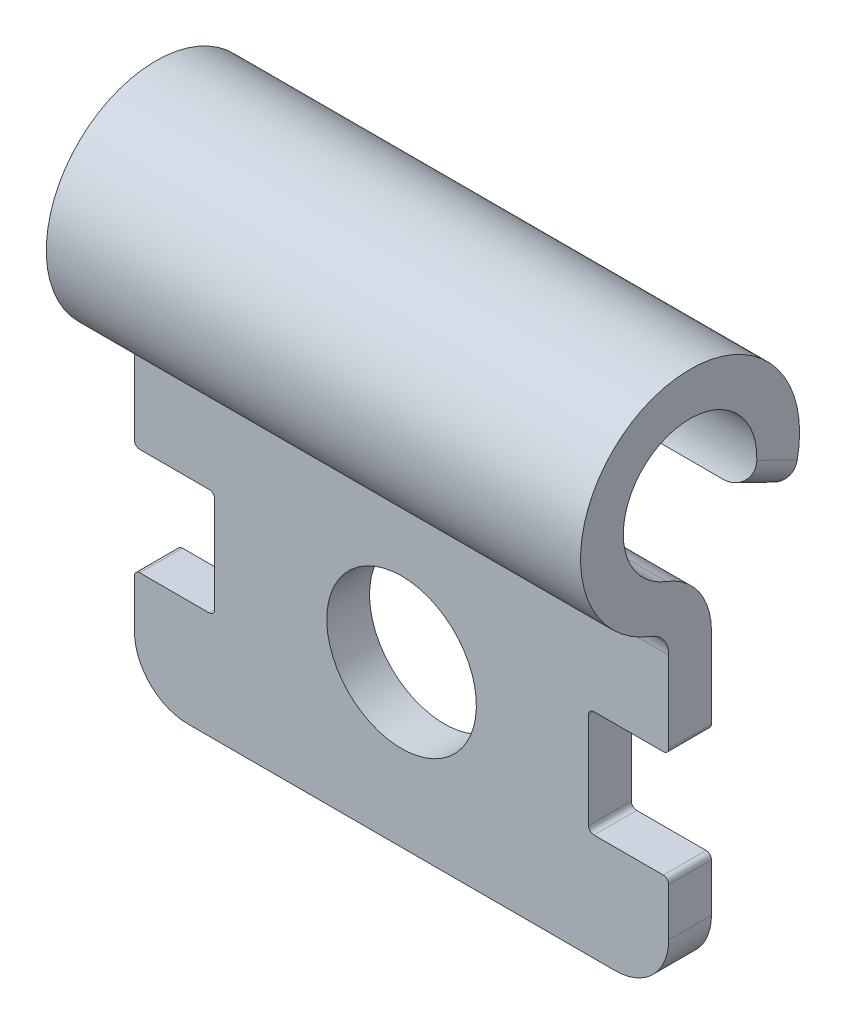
from build123d import *

# Parameters (mm, degrees)
EXTRUDE_THIN1_DEPTH = 10
SKETCH2_R           = 1.4
CUT_EXTRUDE1_DEPTH  = 14.038500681
SKETCH3_W           = 1.5
SKETCH3_H           = 2
CUT_EXTRUDE2_DEPTH  = 14.038500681
FILLET1_R           = 0.5
FILLET2_R           = 1
FILLET3_R           = 0.1


with BuildPart() as part:
    # Sketch1 → Extrude-Thin1 (new body)
    with BuildSketch(Plane(origin=(0, 0, 0), x_dir=(0, 0, -1), z_dir=(1, 0, 0))):
        with BuildLine():
            ThreePointArc((1.842558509, -0.898597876), (-0.756894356, 1.905153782), (-0.723529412, -1.918073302))
            ThreePointArc((-0.723529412, -1.918073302), (-0.48876084, -2.101497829), (-0.4, -2.385896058))
            Line((-0.4, -2.385896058), (-0.4, -8))
            Line((-0.4, -8), (0.4, -8))
            Line((0.4, -8), (0.4, -2.385896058))
            ThreePointArc((0.4, -2.385896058), (0.169221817, -1.646460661), (-0.441176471, -1.169556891))
            ThreePointArc((-0.441176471, -1.169556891), (-0.461520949, 1.161679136), (1.123511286, -0.547925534))
            Line((1.123511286, -0.547925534), (1.842558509, -0.898597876))
        make_face()
    extrude(amount=EXTRUDE_THIN1_DEPTH)

    # Sketch2 → Cut-Extrude1 (cut, through all)
    with BuildSketch(Plane(origin=(0, 0, -0.4), x_dir=(-1, 0, 0), z_dir=(0, 0, -1))):
        with Locations(Location((-5, -5, 0), (0, 0, 90))):
            Circle(SKETCH2_R)
    extrude(amount=-CUT_EXTRUDE1_DEPTH, mode=Mode.SUBTRACT)

    # Sketch3 → Cut-Extrude2 (cut, through all)
    with BuildSketch(Plane.XY.offset(0.4)):
        with Locations((0.75, -5)):
            Rectangle(SKETCH3_W, SKETCH3_H)
        with Locations((9.25, -5)):
            Rectangle(SKETCH3_W, SKETCH3_H)
    extrude(amount=-CUT_EXTRUDE2_DEPTH, mode=Mode.SUBTRACT)

    # Fillet1
    fillet1_edges = [part.edges().sort_by_distance(p)[0] for p in [
        (10, -0.723261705, -1.483034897),
        (0, -0.723261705, -1.483034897),
    ]]
    fillet(fillet1_edges, radius=FILLET1_R)

    # Fillet2
    fillet2_edges = [part.edges().sort_by_distance(p)[0] for p in [
        (10, -8, 0),
        (0, -8, 0),
    ]]
    fillet(fillet2_edges, radius=FILLET2_R)

    # Fillet3
    fillet3_edges = [part.edges().sort_by_distance(p)[0] for p in [
        (0, -6, 0),
        (0, -4, 0),
        (1.5, -4, 0),
        (1.5, -6, 0),
        (10, -4, 0),
        (10, -6, 0),
        (8.5, -6, 0),
        (8.5, -4, 0),
    ]]
    fillet(fillet3_edges, radius=FILLET3_R)


solid = part.part
